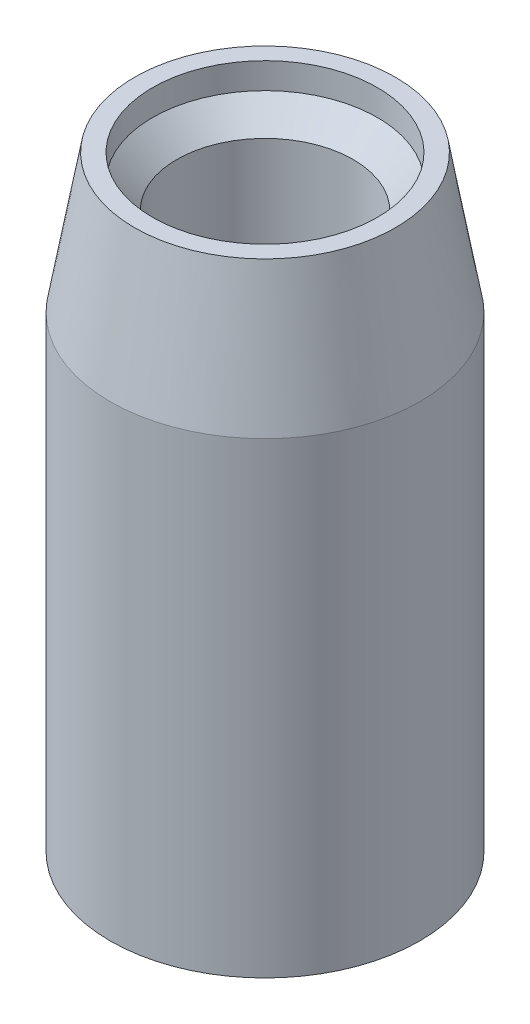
ISO-10303-21;
HEADER;
FILE_DESCRIPTION(('STEP AP214'),'2;1');
FILE_NAME('part.step','',(''),(''),'','','');
FILE_SCHEMA(('AUTOMOTIVE_DESIGN { 1 0 10303 214 1 1 1 1 }'));
ENDSEC;
DATA;
#1=APPLICATION_CONTEXT('core data for automotive mechanical design processes');
#2=APPLICATION_PROTOCOL_DEFINITION('international standard','automotive_design',2000,#1);
#3=PRODUCT_CONTEXT('',#1,'mechanical');
#4=PRODUCT('Part','Part','',(#3));
#5=PRODUCT_RELATED_PRODUCT_CATEGORY('part','',(#4));
#6=PRODUCT_DEFINITION_FORMATION('','',#4);
#7=PRODUCT_DEFINITION_CONTEXT('part definition',#1,'design');
#8=PRODUCT_DEFINITION('design','',#6,#7);
#9=PRODUCT_DEFINITION_SHAPE('','',#8);
#10=(LENGTH_UNIT() NAMED_UNIT(*) SI_UNIT(.MILLI.,.METRE.));
#11=(NAMED_UNIT(*) PLANE_ANGLE_UNIT() SI_UNIT($,.RADIAN.));
#12=(NAMED_UNIT(*) SI_UNIT($,.STERADIAN.) SOLID_ANGLE_UNIT());
#13=UNCERTAINTY_MEASURE_WITH_UNIT(LENGTH_MEASURE(1.E-05),#10,'distance_accuracy_value','');
#14=(GEOMETRIC_REPRESENTATION_CONTEXT(3) GLOBAL_UNCERTAINTY_ASSIGNED_CONTEXT((#13)) GLOBAL_UNIT_ASSIGNED_CONTEXT((#10,
#11,#12)) REPRESENTATION_CONTEXT('',''));
#15=CARTESIAN_POINT('',(0.,0.,0.));
#16=DIRECTION('',(0.,0.,1.));
#17=DIRECTION('',(1.,0.,0.));
#18=AXIS2_PLACEMENT_3D('',#15,#16,#17);
#19=CARTESIAN_POINT('',(0.,0.,0.));
#20=DIRECTION('',(0.,-1.,0.));
#21=DIRECTION('',(0.,0.,-1.));
#22=AXIS2_PLACEMENT_3D('',#19,#20,#21);
#23=CYLINDRICAL_SURFACE('',#22,5.1);
#24=CARTESIAN_POINT('',(0.,32.1,0.));
#25=DIRECTION('',(0.,1.,0.));
#26=DIRECTION('',(0.,0.,1.));
#27=AXIS2_PLACEMENT_3D('',#24,#25,#26);
#28=CIRCLE('',#27,5.1);
#29=CARTESIAN_POINT('',(0.,32.1,5.1));
#30=VERTEX_POINT('',#29);
#31=EDGE_CURVE('E10',#30,#30,#28,.T.);
#32=ORIENTED_EDGE('',*,*,#31,.T.);
#33=EDGE_LOOP('',(#32));
#34=FACE_BOUND('',#33,.T.);
#35=CARTESIAN_POINT('',(0.,0.,0.));
#36=DIRECTION('',(0.,-1.,0.));
#37=DIRECTION('',(0.,0.,-1.));
#38=AXIS2_PLACEMENT_3D('',#35,#36,#37);
#39=CIRCLE('',#38,5.1);
#40=CARTESIAN_POINT('',(0.,0.,-5.1));
#41=VERTEX_POINT('',#40);
#42=EDGE_CURVE('E35',#41,#41,#39,.T.);
#43=ORIENTED_EDGE('',*,*,#42,.T.);
#44=EDGE_LOOP('',(#43));
#45=FACE_BOUND('',#44,.T.);
#46=ADVANCED_FACE('F15',(#34,#45),#23,.F.);
#47=CARTESIAN_POINT('',(7.53938415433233,35.,0.));
#48=DIRECTION('',(0.,1.,0.));
#49=DIRECTION('',(0.,0.,1.));
#50=AXIS2_PLACEMENT_3D('',#47,#48,#49);
#51=PLANE('',#50);
#52=CARTESIAN_POINT('',(0.,35.,0.));
#53=DIRECTION('',(0.,1.,0.));
#54=DIRECTION('',(0.,0.,1.));
#55=AXIS2_PLACEMENT_3D('',#52,#53,#54);
#56=CIRCLE('',#55,6.5);
#57=CARTESIAN_POINT('',(0.,35.,6.5));
#58=VERTEX_POINT('',#57);
#59=EDGE_CURVE('E41',#58,#58,#56,.T.);
#60=ORIENTED_EDGE('',*,*,#59,.F.);
#61=EDGE_LOOP('',(#60));
#62=FACE_BOUND('',#61,.T.);
#63=CARTESIAN_POINT('',(0.,35.,0.));
#64=DIRECTION('',(0.,-1.,0.));
#65=DIRECTION('',(0.,0.,-1.));
#66=AXIS2_PLACEMENT_3D('',#63,#64,#65);
#67=CIRCLE('',#66,7.53938415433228);
#68=CARTESIAN_POINT('',(0.,35.,-7.53938415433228));
#69=VERTEX_POINT('',#68);
#70=EDGE_CURVE('E22',#69,#69,#67,.T.);
#71=ORIENTED_EDGE('',*,*,#70,.F.);
#72=EDGE_LOOP('',(#71));
#73=FACE_BOUND('',#72,.T.);
#74=ADVANCED_FACE('F17',(#62,#73),#51,.T.);
#75=CARTESIAN_POINT('',(0.,27.,0.));
#76=DIRECTION('',(0.,-1.,0.));
#77=DIRECTION('',(0.,0.,-1.));
#78=AXIS2_PLACEMENT_3D('',#75,#76,#77);
#79=CONICAL_SURFACE('',#78,8.95,0.174532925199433);
#80=ORIENTED_EDGE('',*,*,#70,.T.);
#81=EDGE_LOOP('',(#80));
#82=FACE_BOUND('',#81,.T.);
#83=CARTESIAN_POINT('',(0.,27.,0.));
#84=DIRECTION('',(0.,-1.,0.));
#85=DIRECTION('',(0.,0.,-1.));
#86=AXIS2_PLACEMENT_3D('',#83,#84,#85);
#87=CIRCLE('',#86,8.95);
#88=CARTESIAN_POINT('',(0.,27.,-8.95));
#89=VERTEX_POINT('',#88);
#90=EDGE_CURVE('E26',#89,#89,#87,.T.);
#91=ORIENTED_EDGE('',*,*,#90,.F.);
#92=EDGE_LOOP('',(#91));
#93=FACE_BOUND('',#92,.T.);
#94=ADVANCED_FACE('F49',(#82,#93),#79,.T.);
#95=CARTESIAN_POINT('',(0.,0.,0.));
#96=DIRECTION('',(0.,-1.,0.));
#97=DIRECTION('',(0.,0.,-1.));
#98=AXIS2_PLACEMENT_3D('',#95,#96,#97);
#99=CYLINDRICAL_SURFACE('',#98,8.95);
#100=ORIENTED_EDGE('',*,*,#90,.T.);
#101=EDGE_LOOP('',(#100));
#102=FACE_BOUND('',#101,.T.);
#103=CARTESIAN_POINT('',(0.,0.,0.));
#104=DIRECTION('',(0.,-1.,0.));
#105=DIRECTION('',(0.,0.,-1.));
#106=AXIS2_PLACEMENT_3D('',#103,#104,#105);
#107=CIRCLE('',#106,8.95);
#108=CARTESIAN_POINT('',(0.,0.,-8.95));
#109=VERTEX_POINT('',#108);
#110=EDGE_CURVE('E30',#109,#109,#107,.T.);
#111=ORIENTED_EDGE('',*,*,#110,.F.);
#112=EDGE_LOOP('',(#111));
#113=FACE_BOUND('',#112,.T.);
#114=ADVANCED_FACE('F56',(#102,#113),#99,.T.);
#115=CARTESIAN_POINT('',(8.95,0.,0.));
#116=DIRECTION('',(0.,1.,0.));
#117=DIRECTION('',(0.,0.,1.));
#118=AXIS2_PLACEMENT_3D('',#115,#116,#117);
#119=PLANE('',#118);
#120=ORIENTED_EDGE('',*,*,#42,.F.);
#121=EDGE_LOOP('',(#120));
#122=FACE_BOUND('',#121,.T.);
#123=ORIENTED_EDGE('',*,*,#110,.T.);
#124=EDGE_LOOP('',(#123));
#125=FACE_BOUND('',#124,.T.);
#126=ADVANCED_FACE('F65',(#122,#125),#119,.F.);
#127=CARTESIAN_POINT('',(0.,33.5,0.));
#128=DIRECTION('',(0.,1.,0.));
#129=DIRECTION('',(0.,0.,1.));
#130=AXIS2_PLACEMENT_3D('',#127,#128,#129);
#131=CYLINDRICAL_SURFACE('',#130,6.5);
#132=CARTESIAN_POINT('',(0.,33.5,0.));
#133=DIRECTION('',(0.,1.,0.));
#134=DIRECTION('',(0.,0.,1.));
#135=AXIS2_PLACEMENT_3D('',#132,#133,#134);
#136=CIRCLE('',#135,6.5);
#137=CARTESIAN_POINT('',(0.,33.5,6.5));
#138=VERTEX_POINT('',#137);
#139=EDGE_CURVE('E38',#138,#138,#136,.T.);
#140=ORIENTED_EDGE('',*,*,#139,.F.);
#141=EDGE_LOOP('',(#140));
#142=FACE_BOUND('',#141,.T.);
#143=ORIENTED_EDGE('',*,*,#59,.T.);
#144=EDGE_LOOP('',(#143));
#145=FACE_BOUND('',#144,.T.);
#146=ADVANCED_FACE('F45',(#142,#145),#131,.F.);
#147=CARTESIAN_POINT('',(0.,32.1,0.));
#148=DIRECTION('',(0.,1.,0.));
#149=DIRECTION('',(0.,0.,1.));
#150=AXIS2_PLACEMENT_3D('',#147,#148,#149);
#151=CONICAL_SURFACE('',#150,5.1,0.78539816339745);
#152=ORIENTED_EDGE('',*,*,#139,.T.);
#153=EDGE_LOOP('',(#152));
#154=FACE_BOUND('',#153,.T.);
#155=ORIENTED_EDGE('',*,*,#31,.F.);
#156=EDGE_LOOP('',(#155));
#157=FACE_BOUND('',#156,.T.);
#158=ADVANCED_FACE('F95',(#154,#157),#151,.F.);
#159=CLOSED_SHELL('',(#46,#74,#94,#114,#126,#146,#158));
#160=MANIFOLD_SOLID_BREP('B1',#159);
#161=ADVANCED_BREP_SHAPE_REPRESENTATION('',(#18,#160),#14);
#162=SHAPE_DEFINITION_REPRESENTATION(#9,#161);
ENDSEC;
END-ISO-10303-21;
